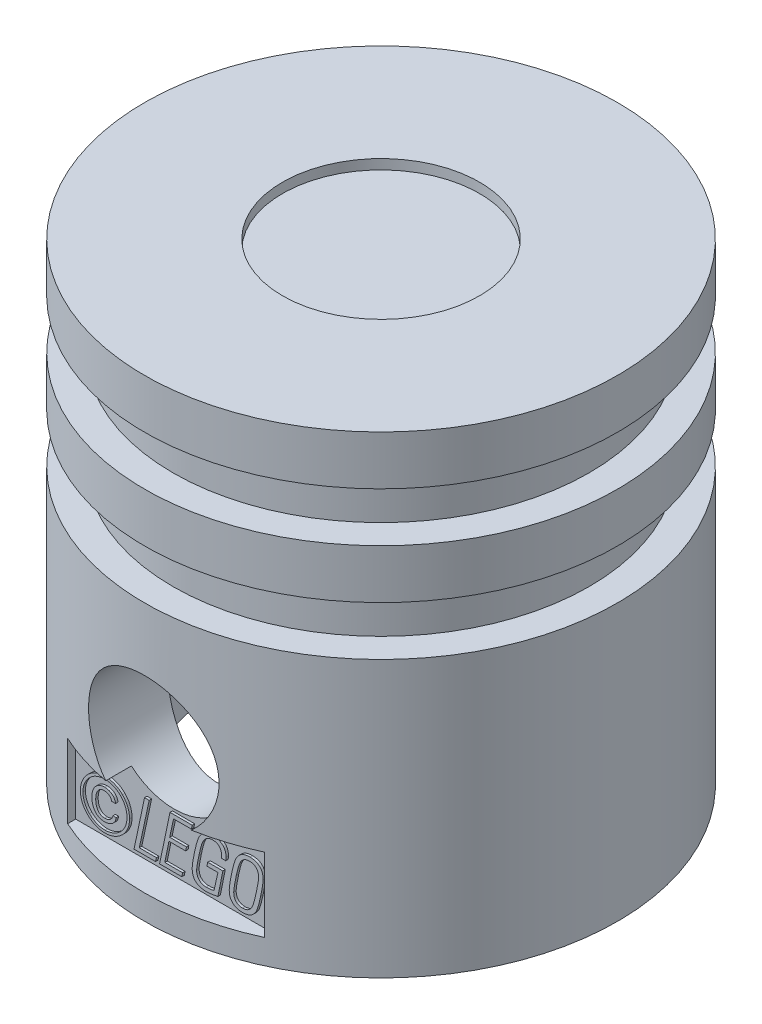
from build123d import *

# Parameters (mm, degrees)
CUT_EXTRUDE1_DEPTH      = 12.757550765
CUT_EXTRUDE1_DEPTH_BACK = 12.757550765
SKETCH2_R               = 1.325
SKETCH3_R               = 2
CUT_EXTRUDE2_DEPTH      = 0.2
SKETCH4_W               = 4
SKETCH4_H               = 1.5
CUT_EXTRUDE3_DEPTH      = 1
BOSS_EXTRUDE1_DEPTH     = 0.05


with BuildPart() as part:
    # Sketch1 → Base-Revolve (revolve)
    with BuildSketch(Plane.XY, mode=Mode.PRIVATE) as base_revolve_sk:
        with BuildLine():
            Line((4.225, 8.6), (4.8, 8.6))
            Line((4.8, 8.6), (4.8, 9.6))
            Line((4.8, 9.6), (0, 9.6))
            Line((0, 9.6), (0, 6))
            ThreePointArc((0, 6), (2.121320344, 5.121320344), (3, 3))
            Line((3, 3), (3.3, 3))
            Line((3.3, 3), (3.3, 0))
            Line((3.3, 0), (4.8, 0))
            Line((4.8, 0), (4.8, 5.6))
            Line((4.8, 5.6), (4.225, 5.6))
            Line((4.225, 5.6), (4.225, 6.6))
            Line((4.225, 6.6), (4.8, 6.6))
            Line((4.8, 6.6), (4.8, 7.6))
            Line((4.8, 7.6), (4.225, 7.6))
            Line((4.225, 7.6), (4.225, 8.6))
        make_face()
    revolve(base_revolve_sk.sketch.rotate(Axis((0, 0, 0), (0, 1, 0)), 90), axis=Axis((0, 0, 0), (0, 1, 0)))

    # Sketch2 → Cut-Extrude1 (cut, two sides: drawn at the far end of the back side and taken through both)
    with BuildSketch(Plane.XY.offset(-CUT_EXTRUDE1_DEPTH_BACK)):
        with Locations((0, 3)):
            Circle(SKETCH2_R)
    extrude(amount=CUT_EXTRUDE1_DEPTH + CUT_EXTRUDE1_DEPTH_BACK, mode=Mode.SUBTRACT)

    # Sketch3 → Cut-Extrude2 (cut)
    with BuildSketch(Plane(origin=(0, 9.6, 0), x_dir=(-1, 0, 0), z_dir=(0, 1, 0))):
        with Locations(Location((0, 0, 0), (0, 0, 90))):
            Circle(SKETCH3_R)
    extrude(amount=-CUT_EXTRUDE2_DEPTH, mode=Mode.SUBTRACT)

    # Sketch4 → Cut-Extrude3 (cut)
    with BuildSketch(Plane.XY.offset(4.2)):
        with Locations((0, 1.25)):
            Rectangle(SKETCH4_W, SKETCH4_H)
    extrude(amount=CUT_EXTRUDE3_DEPTH, mode=Mode.SUBTRACT)

    # Sketch5 → Boss-Extrude1 (add)
    # profile 1 of 6: a face of its own
    with BuildSketch(Plane.XY.offset(4.2)):
        with BuildLine():
            add(Edge.make_bspline(
                [(-1.355897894, 1.60012502), (-1.339123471, 1.599621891), (-1.305839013, 1.598623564), (-1.25654656, 1.591715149), (-1.208768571, 1.579562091), (-1.162442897, 1.563184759), (-1.118031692, 1.542289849), (-1.07586131, 1.517084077), (-1.036292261, 1.487396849), (-1.012298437, 1.464647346), (-1.000214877, 1.45319044)],
                knots=[0, 0, 0, 0, 1.018957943, 2.021855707, 3.0162028, 4.009185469, 5.002380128, 5.992645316, 6.989073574, 8, 8, 8, 8], degree=3))
            add(Edge.make_bspline(
                [(-1.000214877, 1.45319044), (-0.988936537, 1.441395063), (-0.966471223, 1.417899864), (-0.937642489, 1.378703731), (-0.912585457, 1.337133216), (-0.892333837, 1.292917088), (-0.875947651, 1.246907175), (-0.864556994, 1.199272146), (-0.857055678, 1.150439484), (-0.856297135, 1.117396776), (-0.855914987, 1.100750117)],
                knots=[0, 0, 0, 0, 1.000946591, 1.993784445, 2.979555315, 3.975955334, 4.974114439, 5.972928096, 6.978776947, 8, 8, 8, 8], degree=3))
            add(Edge.make_bspline(
                [(-0.855914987, 1.100750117), (-0.856314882, 1.083904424), (-0.857103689, 1.050675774), (-0.86422886, 1.001720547), (-0.8757708, 0.95454924), (-0.891821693, 0.909175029), (-0.912307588, 0.86589309), (-0.937286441, 0.824978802), (-0.966189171, 0.786069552), (-0.988795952, 0.762732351), (-1.000214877, 0.750944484)],
                knots=[0, 0, 0, 0, 1.039328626, 2.050107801, 3.04630548, 4.032829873, 5.015822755, 5.996291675, 6.987905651, 8, 8, 8, 8], degree=3))
            add(Edge.make_bspline(
                [(-1.000214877, 0.750944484), (-1.012554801, 0.739330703), (-1.037035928, 0.716290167), (-1.077576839, 0.686539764), (-1.120188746, 0.660659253), (-1.164976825, 0.639169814), (-1.211350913, 0.622318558), (-1.258826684, 0.61041234), (-1.307076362, 0.602748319), (-1.339588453, 0.601833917), (-1.355897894, 0.601375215)],
                knots=[0, 0, 0, 0, 1.026834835, 2.037133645, 3.042569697, 4.046736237, 5.044640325, 6.02933777, 7.011432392, 8, 8, 8, 8], degree=3))
            add(Edge.make_bspline(
                [(-1.355897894, 0.601375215), (-1.372272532, 0.601850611), (-1.404837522, 0.602796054), (-1.453036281, 0.610153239), (-1.500188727, 0.621873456), (-1.545901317, 0.638578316), (-1.590016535, 0.659550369), (-1.631614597, 0.68541261), (-1.671410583, 0.714931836), (-1.69539707, 0.737906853), (-1.707527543, 0.749525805)],
                knots=[0, 0, 0, 0, 1.00281557, 1.994345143, 2.98007901, 3.975109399, 4.971043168, 5.966942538, 6.971839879, 8, 8, 8, 8], degree=3))
            add(Edge.make_bspline(
                [(-1.707527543, 0.749525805), (-1.719076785, 0.761520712), (-1.742012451, 0.785341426), (-1.771436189, 0.824887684), (-1.796868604, 0.866590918), (-1.817893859, 0.910438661), (-1.834365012, 0.956215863), (-1.846140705, 1.003324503), (-1.853188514, 1.051694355), (-1.854170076, 1.08431104), (-1.854664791, 1.100750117)],
                knots=[0, 0, 0, 0, 1.021116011, 2.02783661, 3.017680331, 4.015421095, 5.006948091, 5.998492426, 6.991223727, 8, 8, 8, 8], degree=3))
            add(Edge.make_bspline(
                [(-1.854664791, 1.100750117), (-1.854181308, 1.117123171), (-1.853217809, 1.149751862), (-1.845945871, 1.198120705), (-1.833908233, 1.245502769), (-1.8170522, 1.291633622), (-1.795769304, 1.336199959), (-1.77028766, 1.378750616), (-1.740762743, 1.419197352), (-1.717856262, 1.443685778), (-1.706311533, 1.456027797)],
                knots=[0, 0, 0, 0, 0.994980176, 1.982825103, 2.965844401, 3.962221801, 4.963259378, 5.963294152, 6.973512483, 8, 8, 8, 8], degree=3))
            add(Edge.make_bspline(
                [(-1.706311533, 1.456027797), (-1.694569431, 1.467285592), (-1.671261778, 1.48963191), (-1.632635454, 1.518672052), (-1.591510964, 1.543583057), (-1.547827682, 1.563962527), (-1.502197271, 1.580298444), (-1.454782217, 1.591774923), (-1.40583854, 1.598933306), (-1.372676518, 1.599724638), (-1.355897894, 1.60012502)],
                knots=[0, 0, 0, 0, 1.00234497, 1.989618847, 2.972647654, 3.96216877, 4.956928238, 5.956152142, 6.965896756, 8, 8, 8, 8], degree=3))
        make_face()
        with BuildLine():
            add(Edge.make_bspline(
                [(-0.907798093, 1.10034478), (-0.908168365, 1.115229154), (-0.908903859, 1.144794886), (-0.915394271, 1.188527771), (-0.925964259, 1.231067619), (-0.940593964, 1.272255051), (-0.959016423, 1.311772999), (-0.981147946, 1.349268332), (-1.007241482, 1.384350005), (-1.027101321, 1.405738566), (-1.037100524, 1.416507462)],
                knots=[0, 0, 0, 0, 1.018933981, 2.023970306, 3.020439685, 4.01699499, 5.012615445, 6.002099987, 6.994080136, 8, 8, 8, 8], degree=3))
            add(Edge.make_bspline(
                [(-1.037100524, 1.416507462), (-1.047963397, 1.426893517), (-1.069481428, 1.447467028), (-1.105413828, 1.473746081), (-1.143078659, 1.496652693), (-1.182988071, 1.515203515), (-1.224323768, 1.530129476), (-1.267114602, 1.540630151), (-1.311108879, 1.547150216), (-1.340877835, 1.547875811), (-1.355897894, 1.548241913)],
                knots=[0, 0, 0, 0, 1.017557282, 2.015657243, 3.00970618, 4.001009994, 4.993000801, 5.983500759, 6.982566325, 8, 8, 8, 8], degree=3))
            add(Edge.make_bspline(
                [(-1.355897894, 1.548241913), (-1.370781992, 1.547870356), (-1.400347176, 1.54713231), (-1.444019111, 1.540670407), (-1.486420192, 1.530070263), (-1.527349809, 1.515475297), (-1.566503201, 1.497090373), (-1.603358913, 1.474781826), (-1.63812612, 1.44913219), (-1.658956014, 1.429173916), (-1.669425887, 1.419142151)],
                knots=[0, 0, 0, 0, 1.025734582, 2.03747875, 3.036079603, 4.034897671, 5.028729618, 6.012822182, 7.001171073, 8, 8, 8, 8], degree=3))
            add(Edge.make_bspline(
                [(-1.669425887, 1.419142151), (-1.679768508, 1.407971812), (-1.700250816, 1.38585031), (-1.727134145, 1.349706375), (-1.750115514, 1.311474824), (-1.769159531, 1.271342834), (-1.784125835, 1.229861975), (-1.795028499, 1.187408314), (-1.801388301, 1.144111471), (-1.802316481, 1.114957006), (-1.802781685, 1.10034478)],
                knots=[0, 0, 0, 0, 1.030362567, 2.040508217, 3.044001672, 4.046733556, 5.043824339, 6.025813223, 7.010537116, 8, 8, 8, 8], degree=3))
            add(Edge.make_bspline(
                [(-1.802781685, 1.10034478), (-1.802322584, 1.085731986), (-1.801410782, 1.056710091), (-1.795012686, 1.013617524), (-1.78411256, 0.971528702), (-1.769407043, 0.930412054), (-1.750574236, 0.890861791), (-1.727706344, 0.853474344), (-1.701325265, 0.818083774), (-1.681063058, 0.796625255), (-1.670844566, 0.785803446)],
                knots=[0, 0, 0, 0, 1.001897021, 1.989828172, 2.979668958, 3.97900318, 4.979796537, 5.977647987, 6.980101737, 8, 8, 8, 8], degree=3))
            add(Edge.make_bspline(
                [(-1.670844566, 0.785803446), (-1.660018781, 0.775590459), (-1.638483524, 0.755274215), (-1.603064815, 0.728767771), (-1.565533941, 0.705901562), (-1.526045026, 0.686841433), (-1.484954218, 0.671887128), (-1.442759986, 0.661015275), (-1.39959879, 0.654640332), (-1.370510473, 0.653720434), (-1.355897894, 0.653258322)],
                knots=[0, 0, 0, 0, 1.018033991, 2.025130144, 3.021157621, 4.022120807, 5.021202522, 6.009233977, 6.999934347, 8, 8, 8, 8], degree=3))
            add(Edge.make_bspline(
                [(-1.355897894, 0.653258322), (-1.341281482, 0.653698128), (-1.312108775, 0.654575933), (-1.268799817, 0.661327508), (-1.226190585, 0.67200828), (-1.18464657, 0.687355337), (-1.144445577, 0.706495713), (-1.106141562, 0.729524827), (-1.070018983, 0.756282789), (-1.048121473, 0.776863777), (-1.037100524, 0.787222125)],
                knots=[0, 0, 0, 0, 0.988726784, 1.973386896, 2.95907585, 3.956986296, 4.965064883, 5.967811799, 6.977205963, 8, 8, 8, 8], degree=3))
            add(Edge.make_bspline(
                [(-1.037100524, 0.787222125), (-1.026916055, 0.797745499), (-1.006685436, 0.818649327), (-0.981009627, 0.853651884), (-0.95825775, 0.890222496), (-0.940241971, 0.929271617), (-0.925664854, 0.969933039), (-0.915461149, 1.012193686), (-0.908865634, 1.055820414), (-0.908156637, 1.085390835), (-0.907798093, 1.10034478)],
                knots=[0, 0, 0, 0, 1.008934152, 2.004165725, 2.987050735, 3.975046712, 4.963888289, 5.961734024, 6.969236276, 8, 8, 8, 8], degree=3))
        make_face(mode=Mode.SUBTRACT)
    # profile 2 of 6: a face of its own
    with BuildSketch(Plane.XY.offset(4.2)):
        with BuildLine():
            add(Edge.make_bspline(
                [(-1.219096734, 1.228633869), (-1.22150417, 1.237055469), (-1.2262011, 1.253486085), (-1.238048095, 1.275743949), (-1.252815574, 1.295306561), (-1.271031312, 1.311476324), (-1.29186109, 1.324652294), (-1.31535903, 1.333963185), (-1.341156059, 1.339808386), (-1.359175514, 1.340403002), (-1.368463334, 1.340709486)],
                knots=[0, 0, 0, 0, 1.034583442, 2.018481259, 2.965600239, 3.922832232, 4.88602793, 5.869340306, 6.901787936, 8, 8, 8, 8], degree=3))
            add(Edge.make_bspline(
                [(-1.368463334, 1.340709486), (-1.375164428, 1.340527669), (-1.388300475, 1.340171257), (-1.407381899, 1.337005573), (-1.425379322, 1.332225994), (-1.442250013, 1.32527133), (-1.457836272, 1.316071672), (-1.472331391, 1.305056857), (-1.485704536, 1.292092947), (-1.497731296, 1.277139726), (-1.508516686, 1.260423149), (-1.517845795, 1.242074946), (-1.525740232, 1.222117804), (-1.532206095, 1.20055045), (-1.537223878, 1.1773726), (-1.540900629, 1.152599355), (-1.542817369, 1.12618139), (-1.54317977, 1.108048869), (-1.543366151, 1.098723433)],
                knots=[0, 0, 0, 0, 0.954364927, 1.870826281, 2.749014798, 3.603666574, 4.462321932, 5.321139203, 6.192652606, 7.109872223, 8.049900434, 9.023020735, 10.038511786, 11.104546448, 12.228195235, 13.415499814, 14.67080855, 16, 16, 16, 16], degree=3))
            add(Edge.make_bspline(
                [(-1.543366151, 1.098723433), (-1.543200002, 1.089801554), (-1.54287598, 1.072402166), (-1.540663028, 1.047002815), (-1.536867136, 1.023008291), (-1.531354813, 1.000465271), (-1.524517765, 0.979269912), (-1.516063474, 0.95953036), (-1.505739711, 0.941395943), (-1.494358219, 0.924536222), (-1.481357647, 0.909584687), (-1.467310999, 0.896421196), (-1.45202404, 0.885434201), (-1.435601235, 0.876453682), (-1.418176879, 0.869247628), (-1.399465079, 0.864509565), (-1.379786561, 0.861326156), (-1.366247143, 0.86097156), (-1.359343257, 0.860790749)],
                knots=[0, 0, 0, 0, 1.263666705, 2.46439412, 3.608060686, 4.701172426, 5.748162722, 6.759612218, 7.736430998, 8.699894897, 9.636077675, 10.536616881, 11.420945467, 12.294596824, 13.183057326, 14.083596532, 15.022806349, 16, 16, 16, 16], degree=3))
            add(Edge.make_bspline(
                [(-1.359343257, 0.860790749), (-1.34917931, 0.861233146), (-1.329391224, 0.862094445), (-1.300813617, 0.868387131), (-1.274631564, 0.879390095), (-1.25091865, 0.894305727), (-1.230388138, 0.913026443), (-1.213521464, 0.934778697), (-1.200591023, 0.959483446), (-1.195665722, 0.977476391), (-1.19315518, 0.986647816)],
                knots=[0, 0, 0, 0, 1.079119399, 2.10092667, 3.088298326, 4.081569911, 5.061799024, 6.023337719, 6.992448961, 8, 8, 8, 8], degree=3))
            Line((-1.19315518, 0.986647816), (-1.128301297, 0.986647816))
            add(Edge.make_bspline(
                [(-1.128301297, 0.986647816), (-1.129105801, 0.979800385), (-1.130696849, 0.966258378), (-1.135509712, 0.946618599), (-1.141669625, 0.927778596), (-1.150090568, 0.910084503), (-1.16032625, 0.893344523), (-1.172301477, 0.877489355), (-1.186172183, 0.862634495), (-1.201778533, 0.848945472), (-1.218609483, 0.836452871), (-1.236614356, 0.825634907), (-1.255541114, 0.816482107), (-1.275486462, 0.808967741), (-1.296444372, 0.803103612), (-1.318391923, 0.798813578), (-1.341318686, 0.796401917), (-1.356905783, 0.796093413), (-1.364815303, 0.795936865)],
                knots=[0, 0, 0, 0, 0.986260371, 1.95050462, 2.889531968, 3.819800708, 4.748761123, 5.694736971, 6.65970864, 7.65334055, 8.66317646, 9.65680837, 10.656120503, 11.66933233, 12.704332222, 13.768524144, 14.867659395, 16, 16, 16, 16], degree=3))
            add(Edge.make_bspline(
                [(-1.364815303, 0.795936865), (-1.374424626, 0.79612073), (-1.393194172, 0.796479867), (-1.420478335, 0.800729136), (-1.446210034, 0.807202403), (-1.47058842, 0.816069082), (-1.493301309, 0.827936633), (-1.51460656, 0.842245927), (-1.53435447, 0.859155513), (-1.552368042, 0.878664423), (-1.568445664, 0.900353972), (-1.582893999, 0.923734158), (-1.594519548, 0.949294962), (-1.604228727, 0.976492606), (-1.61202408, 1.005479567), (-1.617361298, 1.036274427), (-1.620703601, 1.068924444), (-1.621025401, 1.091283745), (-1.621190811, 1.102776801)],
                knots=[0, 0, 0, 0, 1.021960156, 1.996158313, 2.930921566, 3.843207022, 4.750120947, 5.651545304, 6.569508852, 7.510803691, 8.471453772, 9.439502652, 10.430355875, 11.453832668, 12.510809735, 13.620872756, 14.777088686, 16, 16, 16, 16], degree=3))
            add(Edge.make_bspline(
                [(-1.621190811, 1.102776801), (-1.620930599, 1.113997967), (-1.620423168, 1.13587993), (-1.617254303, 1.167822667), (-1.611559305, 1.19798577), (-1.603596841, 1.2264249), (-1.593806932, 1.253349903), (-1.581344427, 1.278371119), (-1.566658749, 1.301651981), (-1.549840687, 1.323063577), (-1.531318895, 1.342587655), (-1.51095909, 1.359392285), (-1.489344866, 1.373783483), (-1.46622636, 1.385336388), (-1.441742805, 1.394597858), (-1.415746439, 1.400963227), (-1.388381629, 1.404954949), (-1.369693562, 1.405357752), (-1.36015393, 1.405563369)],
                knots=[0, 0, 0, 0, 1.196898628, 2.334025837, 3.419361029, 4.466545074, 5.481092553, 6.470377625, 7.441922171, 8.411995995, 9.370087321, 10.306500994, 11.221801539, 12.13374922, 13.057210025, 14.007902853, 14.983101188, 16, 16, 16, 16], degree=3))
            add(Edge.make_bspline(
                [(-1.36015393, 1.405563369), (-1.35292029, 1.405393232), (-1.338688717, 1.405058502), (-1.317801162, 1.402852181), (-1.297732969, 1.398974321), (-1.278563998, 1.393498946), (-1.26018831, 1.386663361), (-1.242807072, 1.37799317), (-1.226241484, 1.367919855), (-1.210654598, 1.356369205), (-1.196350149, 1.343681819), (-1.183443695, 1.330047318), (-1.172225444, 1.315378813), (-1.162724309, 1.299721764), (-1.154700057, 1.283278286), (-1.14870213, 1.265813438), (-1.143909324, 1.24760405), (-1.142158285, 1.235008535), (-1.141272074, 1.228633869)],
                knots=[0, 0, 0, 0, 1.121250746, 2.205965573, 3.251297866, 4.285503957, 5.292962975, 6.285785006, 7.291501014, 8.29470614, 9.288687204, 10.251738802, 11.200508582, 12.145166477, 13.086568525, 14.030471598, 15.003209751, 16, 16, 16, 16], degree=3))
            Line((-1.141272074, 1.228633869), (-1.219096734, 1.228633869))
        make_face()
    # profile 3 of 6: a face of its own
    with BuildSketch(Plane.XY.offset(4.2)):
        Polygon((-0.76511955, 0.614345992), (-0.55170974, 1.626066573), (-0.457874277, 1.626066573), (-0.658110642, 0.692170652), (-0.311142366, 0.692170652), (-0.327761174, 0.614345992), align=None)
    # profile 4 of 6: a face of its own
    with BuildSketch(Plane.XY.offset(4.2)):
        Polygon((-0.246288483, 0.614345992), (-0.034702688, 1.626066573), (0.415221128, 1.626066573), (0.399210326, 1.548241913), (0.037244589, 1.548241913), (-0.041390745, 1.185060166), (0.298484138, 1.185060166), (0.283284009, 1.107235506), (-0.056388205, 1.107235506), (-0.140292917, 0.692170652), (0.220659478, 0.692170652), (0.206067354, 0.614345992), align=None)
    # profile 5 of 6: a face of its own
    with BuildSketch(Plane.XY.offset(4.2)):
        with BuildLine():
            add(Edge.make_bspline(
                [(0.936889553, 0.632586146), (0.924871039, 0.630187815), (0.901469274, 0.625517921), (0.867209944, 0.619264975), (0.834738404, 0.613686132), (0.804053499, 0.609268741), (0.775205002, 0.605735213), (0.748228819, 0.603399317), (0.723167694, 0.601537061), (0.707066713, 0.601427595), (0.699362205, 0.601375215)],
                knots=[0, 0, 0, 0, 1.225832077, 2.386870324, 3.483325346, 4.521138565, 5.487527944, 6.389900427, 7.229548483, 8, 8, 8, 8], degree=3))
            add(Edge.make_bspline(
                [(0.699362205, 0.601375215), (0.68800419, 0.601539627), (0.665914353, 0.601859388), (0.633878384, 0.605190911), (0.603985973, 0.610379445), (0.576193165, 0.61761612), (0.550613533, 0.627159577), (0.527065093, 0.638663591), (0.505864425, 0.652610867), (0.486673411, 0.668430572), (0.469724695, 0.686408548), (0.455057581, 0.706433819), (0.442582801, 0.728437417), (0.432741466, 0.75261709), (0.424831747, 0.778590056), (0.419115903, 0.806601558), (0.415992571, 0.836601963), (0.415482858, 0.857270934), (0.415221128, 0.867884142)],
                knots=[0, 0, 0, 0, 1.222313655, 2.377238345, 3.462882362, 4.486000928, 5.464004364, 6.397432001, 7.301091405, 8.189403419, 9.069130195, 9.953503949, 10.85555242, 11.784749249, 12.757873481, 13.774795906, 14.85739087, 16, 16, 16, 16], degree=3))
            add(Edge.make_bspline(
                [(0.415221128, 0.867884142), (0.415419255, 0.875859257), (0.415851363, 0.893252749), (0.418220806, 0.921381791), (0.422131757, 0.953751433), (0.426707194, 0.983358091), (0.430828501, 1.009515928), (0.434824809, 1.031085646), (0.438702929, 1.054245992), (0.443549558, 1.078710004), (0.448272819, 1.104771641), (0.453827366, 1.132238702), (0.459675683, 1.161226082), (0.463784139, 1.181008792), (0.465888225, 1.191140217)],
                knots=[0, 0, 0, 0, 0.876487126, 1.911592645, 3.100341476, 4.458879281, 5.203351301, 6.010101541, 6.869316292, 7.783654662, 8.750433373, 9.779746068, 10.862929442, 12, 12, 12, 12], degree=3))
            add(Edge.make_bspline(
                [(0.465888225, 1.191140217), (0.46810161, 1.20120965), (0.472397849, 1.220754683), (0.478938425, 1.249251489), (0.485208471, 1.27614165), (0.491184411, 1.301451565), (0.497341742, 1.324994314), (0.503235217, 1.346946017), (0.508838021, 1.367302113), (0.515984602, 1.391691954), (0.524813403, 1.419168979), (0.535726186, 1.448796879), (0.54643588, 1.474306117), (0.554551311, 1.489384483), (0.558305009, 1.496358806)],
                knots=[0, 0, 0, 0, 1.160392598, 2.252352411, 3.290740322, 4.268182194, 5.179221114, 6.029501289, 6.826431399, 7.555467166, 8.890004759, 10.073631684, 11.108980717, 12, 12, 12, 12], degree=3))
            add(Edge.make_bspline(
                [(0.558305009, 1.496358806), (0.566086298, 1.508885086), (0.581258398, 1.533309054), (0.608985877, 1.565301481), (0.639358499, 1.592423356), (0.672875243, 1.614449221), (0.709710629, 1.63141331), (0.749795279, 1.643524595), (0.793347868, 1.650682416), (0.823435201, 1.65155612), (0.839000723, 1.652008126)],
                knots=[0, 0, 0, 0, 1.045860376, 2.039237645, 2.994234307, 3.929665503, 4.876250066, 5.864225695, 6.895068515, 8, 8, 8, 8], degree=3))
            add(Edge.make_bspline(
                [(0.839000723, 1.652008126), (0.849141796, 1.651822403), (0.868931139, 1.651459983), (0.897736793, 1.648390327), (0.92485129, 1.643339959), (0.950213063, 1.636370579), (0.973684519, 1.627083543), (0.995592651, 1.616266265), (1.015539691, 1.602894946), (1.033826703, 1.587756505), (1.050022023, 1.570700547), (1.064213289, 1.552040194), (1.076185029, 1.531705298), (1.085964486, 1.509670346), (1.093368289, 1.486044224), (1.098910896, 1.460903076), (1.102165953, 1.434090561), (1.102500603, 1.415638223), (1.102672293, 1.406171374)],
                knots=[0, 0, 0, 0, 1.187988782, 2.318247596, 3.389450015, 4.41694543, 5.394441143, 6.343149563, 7.273990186, 8.201324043, 9.119525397, 10.023491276, 10.942545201, 11.878052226, 12.841830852, 13.83862194, 14.891119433, 16, 16, 16, 16], degree=3))
            add(Edge.make_bspline(
                [(1.102672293, 1.406171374), (1.102557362, 1.402590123), (1.10229252, 1.394337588), (1.10130033, 1.380394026), (1.099100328, 1.363397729), (1.097473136, 1.351044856), (1.096592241, 1.344357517)],
                knots=[0, 0, 0, 0, 0.691807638, 1.594182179, 2.69758897, 4, 4, 4, 4], degree=3))
            Line((1.096592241, 1.344357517), (1.096592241, 1.340709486))
            Line((1.096592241, 1.340709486), (1.00762082, 1.340709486))
            add(Edge.make_bspline(
                [(1.00762082, 1.340709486), (1.008352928, 1.345431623), (1.009740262, 1.354380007), (1.010873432, 1.367517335), (1.011810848, 1.379878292), (1.011855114, 1.387996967), (1.011876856, 1.391984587)],
                knots=[0, 0, 0, 0, 1.112961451, 2.109046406, 3.071227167, 4, 4, 4, 4], degree=3))
            add(Edge.make_bspline(
                [(1.011876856, 1.391984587), (1.011689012, 1.399013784), (1.011323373, 1.412696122), (1.00942516, 1.432587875), (1.005689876, 1.451218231), (1.000663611, 1.468663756), (0.994232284, 1.485043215), (0.986003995, 1.500010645), (0.976705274, 1.51402237), (0.965711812, 1.526519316), (0.953499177, 1.537759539), (0.94001976, 1.547521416), (0.925384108, 1.555916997), (0.909412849, 1.562548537), (0.892336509, 1.567894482), (0.874041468, 1.571405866), (0.854597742, 1.573723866), (0.841237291, 1.574026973), (0.83433935, 1.574183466)],
                knots=[0, 0, 0, 0, 1.166547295, 2.270685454, 3.310422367, 4.31425725, 5.280012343, 6.222860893, 7.143051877, 8.064607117, 8.976914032, 9.89162764, 10.820312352, 11.769601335, 12.755186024, 13.783929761, 14.855852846, 16, 16, 16, 16], degree=3))
            add(Edge.make_bspline(
                [(0.83433935, 1.574183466), (0.822958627, 1.573835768), (0.800822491, 1.573159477), (0.769002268, 1.566735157), (0.739793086, 1.556385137), (0.713196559, 1.541788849), (0.689044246, 1.522677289), (0.667158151, 1.49902788), (0.646855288, 1.471025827), (0.635670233, 1.449967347), (0.629846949, 1.439003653)],
                knots=[0, 0, 0, 0, 1.048026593, 2.038469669, 2.978039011, 3.894986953, 4.821840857, 5.804264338, 6.85683226, 8, 8, 8, 8], degree=3))
            add(Edge.make_bspline(
                [(0.629846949, 1.439003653), (0.626990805, 1.433028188), (0.620702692, 1.419872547), (0.612498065, 1.397547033), (0.603719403, 1.371342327), (0.596662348, 1.346832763), (0.590459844, 1.324973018), (0.586010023, 1.306371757), (0.58082118, 1.286288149), (0.575541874, 1.264535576), (0.570208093, 1.24111301), (0.564153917, 1.216188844), (0.558429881, 1.189573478), (0.554333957, 1.17134292), (0.552224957, 1.16195597)],
                knots=[0, 0, 0, 0, 0.826735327, 1.820148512, 2.967388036, 4.278160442, 5.00481677, 5.804905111, 6.666383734, 7.595406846, 8.600254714, 9.666453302, 10.798452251, 12, 12, 12, 12], degree=3))
            add(Edge.make_bspline(
                [(0.552224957, 1.16195597), (0.550010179, 1.151211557), (0.545733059, 1.130462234), (0.539343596, 1.100651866), (0.533999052, 1.07310351), (0.52873509, 1.048037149), (0.524687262, 1.025137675), (0.520635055, 1.004728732), (0.517753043, 0.986639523), (0.514167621, 0.966369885), (0.511185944, 0.943981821), (0.508200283, 0.919882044), (0.506499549, 0.898916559), (0.506168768, 0.885991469), (0.506016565, 0.880044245)],
                knots=[0, 0, 0, 0, 1.380724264, 2.666417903, 3.83700122, 4.912538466, 5.889783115, 6.763609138, 7.531013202, 8.194978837, 9.354142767, 10.372930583, 11.251336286, 12, 12, 12, 12], degree=3))
            add(Edge.make_bspline(
                [(0.506016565, 0.880044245), (0.506161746, 0.872403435), (0.506443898, 0.857553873), (0.508931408, 0.83592852), (0.512942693, 0.815575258), (0.518613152, 0.796425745), (0.525931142, 0.778494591), (0.53482286, 0.761800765), (0.545481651, 0.746469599), (0.557662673, 0.732493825), (0.571169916, 0.719873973), (0.586194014, 0.709125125), (0.60213432, 0.699728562), (0.619430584, 0.692186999), (0.637827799, 0.686294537), (0.6575543, 0.682371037), (0.678339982, 0.679571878), (0.692664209, 0.679325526), (0.69997021, 0.679199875)],
                knots=[0, 0, 0, 0, 1.159097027, 2.25265184, 3.298060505, 4.303502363, 5.27816348, 6.232119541, 7.167667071, 8.105010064, 9.040782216, 9.96554058, 10.902659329, 11.843582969, 12.822654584, 13.827887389, 14.892124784, 16, 16, 16, 16], degree=3))
            add(Edge.make_bspline(
                [(0.69997021, 0.679199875), (0.71403021, 0.679425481), (0.741523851, 0.679866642), (0.781961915, 0.683560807), (0.820904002, 0.689876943), (0.846005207, 0.6965579), (0.858456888, 0.69987205)],
                knots=[0, 0, 0, 0, 1.052006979, 2.057148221, 3.036230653, 4, 4, 4, 4], degree=3))
            Line((0.858456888, 0.69987205), (0.938308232, 1.055352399))
            Line((0.938308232, 1.055352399), (0.713548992, 1.055352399))
            Line((0.713548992, 1.055352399), (0.730370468, 1.133177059))
            Line((0.730370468, 1.133177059), (1.037818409, 1.133177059))
            Line((1.037818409, 1.133177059), (0.968505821, 0.785803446))
            add(Edge.make_bspline(
                [(0.968505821, 0.785803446), (0.966109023, 0.775204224), (0.96114061, 0.753232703), (0.955309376, 0.724966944), (0.95053934, 0.700411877), (0.946509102, 0.67965394), (0.941804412, 0.65684216), (0.938573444, 0.640896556), (0.936889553, 0.632586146)],
                knots=[0, 0, 0, 0, 1.25022728, 2.591642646, 3.320264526, 4.128149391, 5.0244431, 6, 6, 6, 6], degree=3))
        make_face()
    # profile 6 of 6: a face of its own
    with BuildSketch(Plane.XY.offset(4.2)):
        with BuildLine():
            add(Edge.make_bspline(
                [(1.167526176, 0.862614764), (1.167703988, 0.870928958), (1.168097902, 0.889347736), (1.17097474, 0.919432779), (1.175545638, 0.954617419), (1.18167325, 0.994882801), (1.189331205, 1.040308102), (1.199086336, 1.090627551), (1.209602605, 1.146042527), (1.217778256, 1.184467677), (1.222043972, 1.204516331)],
                knots=[0, 0, 0, 0, 0.575618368, 1.2751913, 2.090889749, 3.032200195, 4.094896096, 5.28012256, 6.580880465, 8, 8, 8, 8], degree=3))
            add(Edge.make_bspline(
                [(1.222043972, 1.204516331), (1.225580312, 1.221296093), (1.232445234, 1.253869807), (1.244273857, 1.300851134), (1.25552059, 1.344911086), (1.267702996, 1.385245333), (1.279479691, 1.421418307), (1.290650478, 1.452513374), (1.301251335, 1.47817743), (1.308965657, 1.492956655), (1.312434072, 1.4996015)],
                knots=[0, 0, 0, 0, 1.329892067, 2.581652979, 3.757237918, 4.856338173, 5.848855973, 6.707462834, 7.418866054, 8, 8, 8, 8], degree=3))
            add(Edge.make_bspline(
                [(1.312434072, 1.4996015), (1.31641981, 1.506062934), (1.324273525, 1.518794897), (1.337023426, 1.536830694), (1.350427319, 1.553416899), (1.364204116, 1.568810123), (1.378811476, 1.582518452), (1.393890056, 1.594903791), (1.409313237, 1.606239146), (1.431167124, 1.61923949), (1.460966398, 1.632714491), (1.500223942, 1.64387561), (1.543291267, 1.650918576), (1.573306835, 1.651636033), (1.58887375, 1.652008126)],
                knots=[0, 0, 0, 0, 0.82075713, 1.617264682, 2.386162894, 3.125665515, 3.849083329, 4.549605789, 5.234880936, 5.916369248, 7.29592212, 8.756850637, 10.318011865, 12, 12, 12, 12], degree=3))
            add(Edge.make_bspline(
                [(1.58887375, 1.652008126), (1.599354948, 1.651847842), (1.619695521, 1.651536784), (1.649229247, 1.648154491), (1.676932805, 1.643025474), (1.702721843, 1.635525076), (1.726615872, 1.625951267), (1.748679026, 1.614450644), (1.76872454, 1.600515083), (1.786751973, 1.584463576), (1.802928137, 1.566497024), (1.816962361, 1.546569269), (1.828689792, 1.524669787), (1.838613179, 1.501055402), (1.845645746, 1.475314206), (1.851222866, 1.447917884), (1.854478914, 1.418544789), (1.854807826, 1.398342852), (1.85497734, 1.38793122)],
                knots=[0, 0, 0, 0, 1.175277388, 2.280828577, 3.330169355, 4.332652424, 5.288203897, 6.213680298, 7.11765186, 8.019524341, 8.915743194, 9.824056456, 10.746424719, 11.697819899, 12.690920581, 13.734278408, 14.832297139, 16, 16, 16, 16], degree=3))
            add(Edge.make_bspline(
                [(1.85497734, 1.38793122), (1.854785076, 1.380225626), (1.854367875, 1.363505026), (1.851892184, 1.336340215), (1.848330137, 1.305098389), (1.843904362, 1.276362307), (1.839697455, 1.250985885), (1.836067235, 1.229554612), (1.831744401, 1.206339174), (1.827162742, 1.181180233), (1.821824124, 1.154318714), (1.81618098, 1.125587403), (1.809851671, 1.095074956), (1.805523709, 1.074065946), (1.803296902, 1.063256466)],
                knots=[0, 0, 0, 0, 0.842807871, 1.828834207, 2.981748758, 4.28162173, 5.007991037, 5.795100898, 6.658829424, 7.590630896, 8.591902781, 9.654024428, 10.792957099, 12, 12, 12, 12], degree=3))
            add(Edge.make_bspline(
                [(1.803296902, 1.063256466), (1.800932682, 1.052447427), (1.796351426, 1.031502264), (1.789679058, 1.001015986), (1.783258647, 0.972558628), (1.776914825, 0.946089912), (1.770916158, 0.921680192), (1.764997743, 0.899259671), (1.759313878, 0.878877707), (1.752517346, 0.854874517), (1.744204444, 0.828102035), (1.733599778, 0.799382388), (1.723145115, 0.774517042), (1.715047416, 0.759805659), (1.711285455, 0.752971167)],
                knots=[0, 0, 0, 0, 1.226824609, 2.37727363, 3.460296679, 4.461369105, 5.395165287, 6.247276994, 7.032354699, 7.741269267, 9.013447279, 10.139147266, 11.135500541, 12, 12, 12, 12], degree=3))
            add(Edge.make_bspline(
                [(1.711285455, 0.752971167), (1.707595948, 0.746628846), (1.70034258, 0.734160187), (1.687969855, 0.716685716), (1.675209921, 0.700302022), (1.661395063, 0.685389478), (1.647132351, 0.671616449), (1.632009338, 0.659166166), (1.616161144, 0.647981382), (1.599489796, 0.638032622), (1.581964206, 0.62924488), (1.563509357, 0.621796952), (1.544153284, 0.615457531), (1.523807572, 0.610453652), (1.502493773, 0.606430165), (1.48018976, 0.603287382), (1.45689002, 0.601786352), (1.441062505, 0.601513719), (1.433021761, 0.601375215)],
                knots=[0, 0, 0, 0, 1.052351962, 2.068866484, 3.069589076, 4.030112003, 4.98312133, 5.91277099, 6.837962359, 7.763965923, 8.696038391, 9.648307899, 10.617013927, 11.616232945, 12.652386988, 13.728578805, 14.84606553, 16, 16, 16, 16], degree=3))
            add(Edge.make_bspline(
                [(1.433021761, 0.601375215), (1.422744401, 0.601544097), (1.402743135, 0.601872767), (1.373651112, 0.605158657), (1.346395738, 0.61060697), (1.32089017, 0.618136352), (1.297046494, 0.627591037), (1.274995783, 0.639398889), (1.254860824, 0.65348449), (1.23648752, 0.669514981), (1.220262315, 0.687688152), (1.205977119, 0.707519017), (1.194238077, 0.729264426), (1.184442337, 0.752536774), (1.176715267, 0.777575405), (1.17134011, 0.804394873), (1.168016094, 0.832941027), (1.167692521, 0.852539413), (1.167526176, 0.862614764)],
                knots=[0, 0, 0, 0, 1.16414172, 2.265592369, 3.311935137, 4.309808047, 5.274966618, 6.213345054, 7.137059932, 8.05373864, 8.969777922, 9.891651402, 10.816570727, 11.763403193, 12.74883821, 13.780177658, 14.858809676, 16, 16, 16, 16], degree=3))
        make_face()
        with BuildLine():
            add(Edge.make_bspline(
                [(1.582996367, 1.574183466), (1.571415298, 1.57390066), (1.549102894, 1.573355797), (1.517332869, 1.567336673), (1.488681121, 1.557918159), (1.463012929, 1.544247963), (1.439997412, 1.525757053), (1.418817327, 1.502449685), (1.399116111, 1.474039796), (1.387989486, 1.452655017), (1.382151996, 1.441435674)],
                knots=[0, 0, 0, 0, 1.080335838, 2.08140476, 3.007134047, 3.887802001, 4.781481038, 5.750383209, 6.819757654, 8, 8, 8, 8], degree=3))
            add(Edge.make_bspline(
                [(1.382151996, 1.441435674), (1.379720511, 1.43612654), (1.374137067, 1.423935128), (1.366521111, 1.402667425), (1.35795578, 1.376393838), (1.349100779, 1.345381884), (1.339652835, 1.310382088), (1.329941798, 1.272152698), (1.320187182, 1.230943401), (1.314007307, 1.202432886), (1.310812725, 1.187694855)],
                knots=[0, 0, 0, 0, 0.530694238, 1.218638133, 2.051874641, 3.043172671, 4.150157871, 5.347821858, 6.629001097, 8, 8, 8, 8], degree=3))
            add(Edge.make_bspline(
                [(1.310812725, 1.187694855), (1.308500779, 1.176551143), (1.304033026, 1.155016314), (1.297780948, 1.123650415), (1.291829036, 1.094358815), (1.286681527, 1.067029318), (1.281659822, 1.041805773), (1.277549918, 1.018594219), (1.273555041, 0.997418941), (1.2694725, 0.972685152), (1.265038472, 0.945307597), (1.261422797, 0.916031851), (1.258974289, 0.891366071), (1.258523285, 0.876400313), (1.258321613, 0.869708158)],
                knots=[0, 0, 0, 0, 1.269945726, 2.454125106, 3.568819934, 4.605187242, 5.557279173, 6.438514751, 7.235470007, 7.961690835, 9.235746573, 10.329704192, 11.25310301, 12, 12, 12, 12], degree=3))
            add(Edge.make_bspline(
                [(1.258321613, 0.869708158), (1.258486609, 0.862406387), (1.258809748, 0.848106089), (1.26105161, 0.827302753), (1.26465204, 0.807771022), (1.269729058, 0.789492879), (1.27638043, 0.772511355), (1.284550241, 0.756760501), (1.294123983, 0.742285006), (1.305077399, 0.729047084), (1.317447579, 0.717255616), (1.331190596, 0.707100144), (1.345969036, 0.698252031), (1.362200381, 0.691431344), (1.379442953, 0.68600117), (1.397853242, 0.681804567), (1.41757014, 0.679712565), (1.431126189, 0.679373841), (1.438088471, 0.679199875)],
                knots=[0, 0, 0, 0, 1.177093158, 2.305301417, 3.369110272, 4.375974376, 5.358932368, 6.303989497, 7.231370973, 8.151754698, 9.068522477, 9.979058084, 10.901823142, 11.838559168, 12.809923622, 13.814074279, 14.877325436, 16, 16, 16, 16], degree=3))
            add(Edge.make_bspline(
                [(1.438088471, 0.679199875), (1.449466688, 0.679566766), (1.471373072, 0.680273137), (1.502819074, 0.686302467), (1.531448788, 0.695915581), (1.557485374, 0.709791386), (1.581013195, 0.728345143), (1.602495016, 0.751544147), (1.622318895, 0.779343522), (1.633241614, 0.800245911), (1.638932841, 0.811136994)],
                knots=[0, 0, 0, 0, 1.066706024, 2.053720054, 2.991776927, 3.890687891, 4.807366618, 5.789382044, 6.848168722, 8, 8, 8, 8], degree=3))
            add(Edge.make_bspline(
                [(1.638932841, 0.811136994), (1.641628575, 0.817259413), (1.647546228, 0.830699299), (1.655739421, 0.853161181), (1.663935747, 0.879671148), (1.672739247, 0.910411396), (1.682094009, 0.946082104), (1.691919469, 0.987270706), (1.702673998, 1.034086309), (1.709901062, 1.067234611), (1.713717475, 1.084739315)],
                knots=[0, 0, 0, 0, 0.565071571, 1.240440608, 2.018442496, 2.909050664, 3.941793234, 5.133691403, 6.486381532, 8, 8, 8, 8], degree=3))
            add(Edge.make_bspline(
                [(1.713717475, 1.084739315), (1.716092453, 1.095748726), (1.720680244, 1.117015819), (1.72713483, 1.147760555), (1.733048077, 1.176194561), (1.738314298, 1.202339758), (1.742992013, 1.226184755), (1.746968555, 1.247762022), (1.750782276, 1.266961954), (1.754309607, 1.289019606), (1.758337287, 1.313278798), (1.761464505, 1.339387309), (1.763784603, 1.361745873), (1.764057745, 1.375428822), (1.764181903, 1.3816485)],
                knots=[0, 0, 0, 0, 1.344629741, 2.597447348, 3.750577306, 4.811939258, 5.781569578, 6.65158919, 7.431436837, 8.118277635, 9.318319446, 10.366731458, 11.257586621, 12, 12, 12, 12], degree=3))
            add(Edge.make_bspline(
                [(1.764181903, 1.3816485), (1.763989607, 1.389149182), (1.763616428, 1.403705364), (1.761782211, 1.424970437), (1.757749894, 1.444762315), (1.752898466, 1.463389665), (1.746002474, 1.48044085), (1.738234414, 1.496534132), (1.728395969, 1.5110006), (1.717438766, 1.524345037), (1.705048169, 1.53611774), (1.69128455, 1.546349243), (1.676364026, 1.555070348), (1.660051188, 1.561999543), (1.642588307, 1.567404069), (1.623835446, 1.571575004), (1.60378374, 1.573663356), (1.590026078, 1.574007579), (1.582996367, 1.574183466)],
                knots=[0, 0, 0, 0, 1.196268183, 2.321535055, 3.396668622, 4.413069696, 5.38507652, 6.324309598, 7.256289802, 8.1664195, 9.072973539, 9.973364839, 10.895145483, 11.821445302, 12.792258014, 13.806259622, 14.879071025, 16, 16, 16, 16], degree=3))
        make_face(mode=Mode.SUBTRACT)
    extrude(amount=BOSS_EXTRUDE1_DEPTH)


solid = part.part
